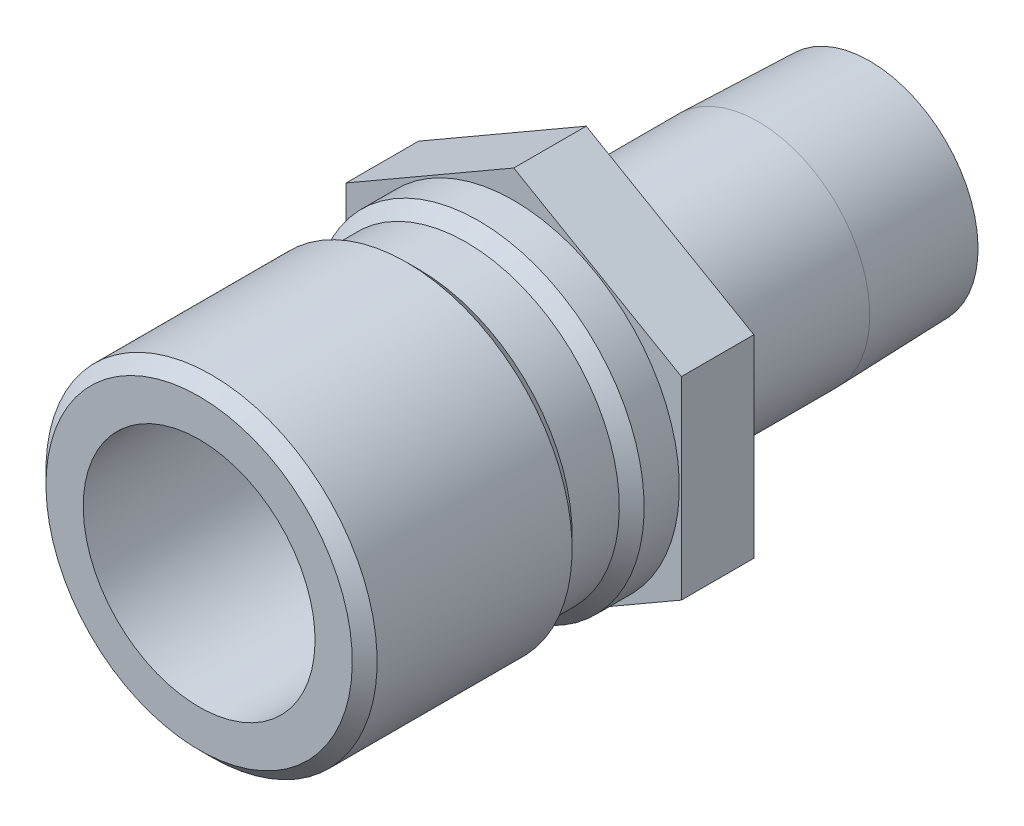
ISO-10303-21;
HEADER;
FILE_DESCRIPTION(('STEP AP214'),'2;1');
FILE_NAME('part.step','',(''),(''),'','','');
FILE_SCHEMA(('AUTOMOTIVE_DESIGN { 1 0 10303 214 1 1 1 1 }'));
ENDSEC;
DATA;
#1=APPLICATION_CONTEXT('core data for automotive mechanical design processes');
#2=APPLICATION_PROTOCOL_DEFINITION('international standard','automotive_design',2000,#1);
#3=PRODUCT_CONTEXT('',#1,'mechanical');
#4=PRODUCT('Part','Part','',(#3));
#5=PRODUCT_RELATED_PRODUCT_CATEGORY('part','',(#4));
#6=PRODUCT_DEFINITION_FORMATION('','',#4);
#7=PRODUCT_DEFINITION_CONTEXT('part definition',#1,'design');
#8=PRODUCT_DEFINITION('design','',#6,#7);
#9=PRODUCT_DEFINITION_SHAPE('','',#8);
#10=(LENGTH_UNIT() NAMED_UNIT(*) SI_UNIT(.MILLI.,.METRE.));
#11=(NAMED_UNIT(*) PLANE_ANGLE_UNIT() SI_UNIT($,.RADIAN.));
#12=(NAMED_UNIT(*) SI_UNIT($,.STERADIAN.) SOLID_ANGLE_UNIT());
#13=UNCERTAINTY_MEASURE_WITH_UNIT(LENGTH_MEASURE(1.E-05),#10,'distance_accuracy_value','');
#14=(GEOMETRIC_REPRESENTATION_CONTEXT(3) GLOBAL_UNCERTAINTY_ASSIGNED_CONTEXT((#13)) GLOBAL_UNIT_ASSIGNED_CONTEXT((#10,
#11,#12)) REPRESENTATION_CONTEXT('',''));
#15=CARTESIAN_POINT('',(0.,0.,0.));
#16=DIRECTION('',(0.,0.,1.));
#17=DIRECTION('',(1.,0.,0.));
#18=AXIS2_PLACEMENT_3D('',#15,#16,#17);
#19=CARTESIAN_POINT('',(0.,0.,0.));
#20=DIRECTION('',(0.,0.,-1.));
#21=DIRECTION('',(0.,1.,0.));
#22=AXIS2_PLACEMENT_3D('',#19,#20,#21);
#23=CYLINDRICAL_SURFACE('',#22,6.85799999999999);
#24=CARTESIAN_POINT('',(0.,0.,-14.986));
#25=DIRECTION('',(0.,0.,-1.));
#26=DIRECTION('',(0.,1.,0.));
#27=AXIS2_PLACEMENT_3D('',#24,#25,#26);
#28=CIRCLE('',#27,6.85799999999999);
#29=CARTESIAN_POINT('',(0.,6.858,-14.986));
#30=VERTEX_POINT('',#29);
#31=EDGE_CURVE('E42',#30,#30,#28,.T.);
#32=ORIENTED_EDGE('',*,*,#31,.F.);
#33=EDGE_LOOP('',(#32));
#34=FACE_BOUND('',#33,.T.);
#35=CARTESIAN_POINT('',(0.,0.,-4.445));
#36=DIRECTION('',(0.,0.,1.));
#37=DIRECTION('',(1.,0.,0.));
#38=AXIS2_PLACEMENT_3D('',#35,#36,#37);
#39=CIRCLE('',#38,6.85799999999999);
#40=CARTESIAN_POINT('',(6.85799999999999,0.,-4.445));
#41=VERTEX_POINT('',#40);
#42=EDGE_CURVE('E138',#41,#41,#39,.F.);
#43=ORIENTED_EDGE('',*,*,#42,.T.);
#44=EDGE_LOOP('',(#43));
#45=FACE_BOUND('',#44,.T.);
#46=ADVANCED_FACE('F33',(#34,#45),#23,.T.);
#47=CARTESIAN_POINT('',(0.,6.6436887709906,-21.844));
#48=DIRECTION('',(0.,0.,-1.));
#49=DIRECTION('',(0.,1.,0.));
#50=AXIS2_PLACEMENT_3D('',#47,#48,#49);
#51=PLANE('',#50);
#52=CARTESIAN_POINT('',(0.,0.,-21.844));
#53=DIRECTION('',(0.,0.,-1.));
#54=DIRECTION('',(0.,1.,0.));
#55=AXIS2_PLACEMENT_3D('',#52,#53,#54);
#56=CIRCLE('',#55,6.6436887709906);
#57=CARTESIAN_POINT('',(0.,6.6436887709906,-21.844));
#58=VERTEX_POINT('',#57);
#59=EDGE_CURVE('E11',#58,#58,#56,.T.);
#60=ORIENTED_EDGE('',*,*,#59,.T.);
#61=EDGE_LOOP('',(#60));
#62=FACE_BOUND('',#61,.T.);
#63=CARTESIAN_POINT('',(0.,0.,-21.844));
#64=DIRECTION('',(0.,0.,-1.));
#65=DIRECTION('',(0.,1.,0.));
#66=AXIS2_PLACEMENT_3D('',#63,#64,#65);
#67=CIRCLE('',#66,4.76249999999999);
#68=CARTESIAN_POINT('',(0.,4.76249999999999,-21.844));
#69=VERTEX_POINT('',#68);
#70=EDGE_CURVE('E146',#69,#69,#67,.T.);
#71=ORIENTED_EDGE('',*,*,#70,.F.);
#72=EDGE_LOOP('',(#71));
#73=FACE_BOUND('',#72,.T.);
#74=ADVANCED_FACE('F35',(#62,#73),#51,.T.);
#75=CARTESIAN_POINT('',(0.,0.,-21.844));
#76=DIRECTION('',(0.,0.,1.));
#77=DIRECTION('',(0.,-1.,0.));
#78=AXIS2_PLACEMENT_3D('',#75,#76,#77);
#79=CONICAL_SURFACE('',#78,6.6436887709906,0.0312396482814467);
#80=ORIENTED_EDGE('',*,*,#31,.T.);
#81=EDGE_LOOP('',(#80));
#82=FACE_BOUND('',#81,.T.);
#83=ORIENTED_EDGE('',*,*,#59,.F.);
#84=EDGE_LOOP('',(#83));
#85=FACE_BOUND('',#84,.T.);
#86=ADVANCED_FACE('F181',(#82,#85),#79,.T.);
#87=CARTESIAN_POINT('',(0.,0.,0.));
#88=DIRECTION('',(0.,0.,-1.));
#89=DIRECTION('',(0.,1.,0.));
#90=AXIS2_PLACEMENT_3D('',#87,#88,#89);
#91=CYLINDRICAL_SURFACE('',#90,10.16);
#92=CARTESIAN_POINT('',(0.,0.,2.159));
#93=DIRECTION('',(0.,0.,-1.));
#94=DIRECTION('',(0.,1.,0.));
#95=AXIS2_PLACEMENT_3D('',#92,#93,#94);
#96=CIRCLE('',#95,10.16);
#97=CARTESIAN_POINT('',(0.,10.16,2.159));
#98=VERTEX_POINT('',#97);
#99=EDGE_CURVE('E173',#98,#98,#96,.T.);
#100=ORIENTED_EDGE('',*,*,#99,.T.);
#101=EDGE_LOOP('',(#100));
#102=FACE_BOUND('',#101,.T.);
#103=CARTESIAN_POINT('',(0.,0.,0.));
#104=DIRECTION('',(0.,0.,-1.));
#105=DIRECTION('',(0.,1.,0.));
#106=AXIS2_PLACEMENT_3D('',#103,#104,#105);
#107=CIRCLE('',#106,10.16);
#108=CARTESIAN_POINT('',(0.,10.16,0.));
#109=VERTEX_POINT('',#108);
#110=EDGE_CURVE('E176',#109,#109,#107,.T.);
#111=ORIENTED_EDGE('',*,*,#110,.F.);
#112=EDGE_LOOP('',(#111));
#113=FACE_BOUND('',#112,.T.);
#114=ADVANCED_FACE('F250',(#102,#113),#91,.T.);
#115=CARTESIAN_POINT('',(0.,0.,2.159));
#116=DIRECTION('',(0.,0.,-1.));
#117=DIRECTION('',(0.,1.,0.));
#118=AXIS2_PLACEMENT_3D('',#115,#116,#117);
#119=CONICAL_SURFACE('',#118,10.16,0.785398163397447);
#120=CARTESIAN_POINT('',(0.,0.,2.921));
#121=DIRECTION('',(0.,0.,-1.));
#122=DIRECTION('',(0.,1.,0.));
#123=AXIS2_PLACEMENT_3D('',#120,#121,#122);
#124=CIRCLE('',#123,9.398);
#125=CARTESIAN_POINT('',(0.,9.398,2.921));
#126=VERTEX_POINT('',#125);
#127=EDGE_CURVE('E170',#126,#126,#124,.T.);
#128=ORIENTED_EDGE('',*,*,#127,.T.);
#129=EDGE_LOOP('',(#128));
#130=FACE_BOUND('',#129,.T.);
#131=ORIENTED_EDGE('',*,*,#99,.F.);
#132=EDGE_LOOP('',(#131));
#133=FACE_BOUND('',#132,.T.);
#134=ADVANCED_FACE('F246',(#130,#133),#119,.T.);
#135=CARTESIAN_POINT('',(0.,0.,0.));
#136=DIRECTION('',(0.,0.,-1.));
#137=DIRECTION('',(0.,1.,0.));
#138=AXIS2_PLACEMENT_3D('',#135,#136,#137);
#139=CYLINDRICAL_SURFACE('',#138,9.398);
#140=CARTESIAN_POINT('',(0.,0.,5.8166));
#141=DIRECTION('',(0.,0.,-1.));
#142=DIRECTION('',(0.,1.,0.));
#143=AXIS2_PLACEMENT_3D('',#140,#141,#142);
#144=CIRCLE('',#143,9.398);
#145=CARTESIAN_POINT('',(0.,9.398,5.8166));
#146=VERTEX_POINT('',#145);
#147=EDGE_CURVE('E167',#146,#146,#144,.T.);
#148=ORIENTED_EDGE('',*,*,#147,.T.);
#149=EDGE_LOOP('',(#148));
#150=FACE_BOUND('',#149,.T.);
#151=ORIENTED_EDGE('',*,*,#127,.F.);
#152=EDGE_LOOP('',(#151));
#153=FACE_BOUND('',#152,.T.);
#154=ADVANCED_FACE('F242',(#150,#153),#139,.T.);
#155=CARTESIAN_POINT('',(0.,0.,5.8166));
#156=DIRECTION('',(0.,0.,1.));
#157=DIRECTION('',(0.,-1.,0.));
#158=AXIS2_PLACEMENT_3D('',#155,#156,#157);
#159=CONICAL_SURFACE('',#158,9.398,0.785398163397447);
#160=CARTESIAN_POINT('',(0.,0.,6.5786));
#161=DIRECTION('',(0.,0.,-1.));
#162=DIRECTION('',(0.,1.,0.));
#163=AXIS2_PLACEMENT_3D('',#160,#161,#162);
#164=CIRCLE('',#163,10.16);
#165=CARTESIAN_POINT('',(0.,10.16,6.5786));
#166=VERTEX_POINT('',#165);
#167=EDGE_CURVE('E164',#166,#166,#164,.T.);
#168=ORIENTED_EDGE('',*,*,#167,.T.);
#169=EDGE_LOOP('',(#168));
#170=FACE_BOUND('',#169,.T.);
#171=ORIENTED_EDGE('',*,*,#147,.F.);
#172=EDGE_LOOP('',(#171));
#173=FACE_BOUND('',#172,.T.);
#174=ADVANCED_FACE('F238',(#170,#173),#159,.T.);
#175=CARTESIAN_POINT('',(0.,0.,0.));
#176=DIRECTION('',(0.,0.,-1.));
#177=DIRECTION('',(0.,1.,0.));
#178=AXIS2_PLACEMENT_3D('',#175,#176,#177);
#179=CYLINDRICAL_SURFACE('',#178,10.16);
#180=CARTESIAN_POINT('',(0.,0.,18.542));
#181=DIRECTION('',(0.,0.,-1.));
#182=DIRECTION('',(0.,1.,0.));
#183=AXIS2_PLACEMENT_3D('',#180,#181,#182);
#184=CIRCLE('',#183,10.16);
#185=CARTESIAN_POINT('',(0.,10.16,18.542));
#186=VERTEX_POINT('',#185);
#187=EDGE_CURVE('E161',#186,#186,#184,.T.);
#188=ORIENTED_EDGE('',*,*,#187,.T.);
#189=EDGE_LOOP('',(#188));
#190=FACE_BOUND('',#189,.T.);
#191=ORIENTED_EDGE('',*,*,#167,.F.);
#192=EDGE_LOOP('',(#191));
#193=FACE_BOUND('',#192,.T.);
#194=ADVANCED_FACE('F234',(#190,#193),#179,.T.);
#195=CARTESIAN_POINT('',(0.,0.,18.542));
#196=DIRECTION('',(0.,0.,-1.));
#197=DIRECTION('',(0.,1.,0.));
#198=AXIS2_PLACEMENT_3D('',#195,#196,#197);
#199=CONICAL_SURFACE('',#198,10.16,0.785398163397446);
#200=CARTESIAN_POINT('',(0.,0.,19.304));
#201=DIRECTION('',(0.,0.,-1.));
#202=DIRECTION('',(0.,1.,0.));
#203=AXIS2_PLACEMENT_3D('',#200,#201,#202);
#204=CIRCLE('',#203,9.398);
#205=CARTESIAN_POINT('',(0.,9.398,19.304));
#206=VERTEX_POINT('',#205);
#207=EDGE_CURVE('E158',#206,#206,#204,.T.);
#208=ORIENTED_EDGE('',*,*,#207,.T.);
#209=EDGE_LOOP('',(#208));
#210=FACE_BOUND('',#209,.T.);
#211=ORIENTED_EDGE('',*,*,#187,.F.);
#212=EDGE_LOOP('',(#211));
#213=FACE_BOUND('',#212,.T.);
#214=ADVANCED_FACE('F230',(#210,#213),#199,.T.);
#215=CARTESIAN_POINT('',(0.,7.112,19.304));
#216=DIRECTION('',(0.,0.,1.));
#217=DIRECTION('',(0.,-1.,0.));
#218=AXIS2_PLACEMENT_3D('',#215,#216,#217);
#219=PLANE('',#218);
#220=CARTESIAN_POINT('',(0.,0.,19.304));
#221=DIRECTION('',(0.,0.,-1.));
#222=DIRECTION('',(0.,1.,0.));
#223=AXIS2_PLACEMENT_3D('',#220,#221,#222);
#224=CIRCLE('',#223,7.112);
#225=CARTESIAN_POINT('',(0.,7.112,19.304));
#226=VERTEX_POINT('',#225);
#227=EDGE_CURVE('E155',#226,#226,#224,.T.);
#228=ORIENTED_EDGE('',*,*,#227,.T.);
#229=EDGE_LOOP('',(#228));
#230=FACE_BOUND('',#229,.T.);
#231=ORIENTED_EDGE('',*,*,#207,.F.);
#232=EDGE_LOOP('',(#231));
#233=FACE_BOUND('',#232,.T.);
#234=ADVANCED_FACE('F226',(#230,#233),#219,.T.);
#235=CARTESIAN_POINT('',(0.,0.,0.));
#236=DIRECTION('',(0.,0.,-1.));
#237=DIRECTION('',(0.,1.,0.));
#238=AXIS2_PLACEMENT_3D('',#235,#236,#237);
#239=CYLINDRICAL_SURFACE('',#238,7.112);
#240=CARTESIAN_POINT('',(0.,0.,1.524));
#241=DIRECTION('',(0.,0.,-1.));
#242=DIRECTION('',(0.,1.,0.));
#243=AXIS2_PLACEMENT_3D('',#240,#241,#242);
#244=CIRCLE('',#243,7.112);
#245=CARTESIAN_POINT('',(0.,7.112,1.524));
#246=VERTEX_POINT('',#245);
#247=EDGE_CURVE('E152',#246,#246,#244,.T.);
#248=ORIENTED_EDGE('',*,*,#247,.T.);
#249=EDGE_LOOP('',(#248));
#250=FACE_BOUND('',#249,.T.);
#251=ORIENTED_EDGE('',*,*,#227,.F.);
#252=EDGE_LOOP('',(#251));
#253=FACE_BOUND('',#252,.T.);
#254=ADVANCED_FACE('F222',(#250,#253),#239,.F.);
#255=CARTESIAN_POINT('',(0.,0.,1.524));
#256=DIRECTION('',(0.,0.,1.));
#257=DIRECTION('',(0.,-1.,0.));
#258=AXIS2_PLACEMENT_3D('',#255,#256,#257);
#259=CONICAL_SURFACE('',#258,7.112,1.08210413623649);
#260=CARTESIAN_POINT('',(0.,0.,0.274748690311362));
#261=DIRECTION('',(0.,0.,-1.));
#262=DIRECTION('',(0.,1.,0.));
#263=AXIS2_PLACEMENT_3D('',#260,#261,#262);
#264=CIRCLE('',#263,4.7625);
#265=CARTESIAN_POINT('',(0.,4.7625,0.274748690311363));
#266=VERTEX_POINT('',#265);
#267=EDGE_CURVE('E149',#266,#266,#264,.T.);
#268=ORIENTED_EDGE('',*,*,#267,.T.);
#269=EDGE_LOOP('',(#268));
#270=FACE_BOUND('',#269,.T.);
#271=ORIENTED_EDGE('',*,*,#247,.F.);
#272=EDGE_LOOP('',(#271));
#273=FACE_BOUND('',#272,.T.);
#274=ADVANCED_FACE('F218',(#270,#273),#259,.F.);
#275=CARTESIAN_POINT('',(0.,0.,0.));
#276=DIRECTION('',(0.,0.,-1.));
#277=DIRECTION('',(0.,1.,0.));
#278=AXIS2_PLACEMENT_3D('',#275,#276,#277);
#279=CYLINDRICAL_SURFACE('',#278,4.76249999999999);
#280=ORIENTED_EDGE('',*,*,#267,.F.);
#281=EDGE_LOOP('',(#280));
#282=FACE_BOUND('',#281,.T.);
#283=ORIENTED_EDGE('',*,*,#70,.T.);
#284=EDGE_LOOP('',(#283));
#285=FACE_BOUND('',#284,.T.);
#286=ADVANCED_FACE('F215',(#282,#285),#279,.F.);
#287=CARTESIAN_POINT('',(0.,11.8784044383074,-4.445));
#288=DIRECTION('',(-0.5,0.866025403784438,0.));
#289=DIRECTION('',(-0.866025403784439,-0.5,0.));
#290=AXIS2_PLACEMENT_3D('',#287,#288,#289);
#291=PLANE('',#290);
#292=DIRECTION('',(-0.866025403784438,-0.5,0.));
#293=VECTOR('',#292,1.);
#294=CARTESIAN_POINT('',(0.,11.8784044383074,0.));
#295=LINE('',#294,#293);
#296=CARTESIAN_POINT('',(0.,11.8784044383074,0.));
#297=VERTEX_POINT('',#296);
#298=CARTESIAN_POINT('',(-10.287,5.93920221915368,0.));
#299=VERTEX_POINT('',#298);
#300=EDGE_CURVE('E121',#297,#299,#295,.T.);
#301=ORIENTED_EDGE('',*,*,#300,.F.);
#302=DIRECTION('',(0.,0.,1.));
#303=VECTOR('',#302,1.);
#304=CARTESIAN_POINT('',(0.,11.8784044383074,-4.445));
#305=LINE('',#304,#303);
#306=CARTESIAN_POINT('',(0.,11.8784044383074,-4.445));
#307=VERTEX_POINT('',#306);
#308=EDGE_CURVE('E50',#307,#297,#305,.T.);
#309=ORIENTED_EDGE('',*,*,#308,.F.);
#310=DIRECTION('',(-0.866025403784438,-0.5,0.));
#311=VECTOR('',#310,1.);
#312=CARTESIAN_POINT('',(0.,11.8784044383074,-4.445));
#313=LINE('',#312,#311);
#314=CARTESIAN_POINT('',(-10.287,5.93920221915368,-4.445));
#315=VERTEX_POINT('',#314);
#316=EDGE_CURVE('E136',#307,#315,#313,.T.);
#317=ORIENTED_EDGE('',*,*,#316,.T.);
#318=DIRECTION('',(0.,0.,1.));
#319=VECTOR('',#318,1.);
#320=CARTESIAN_POINT('',(-10.287,5.93920221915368,-4.445));
#321=LINE('',#320,#319);
#322=EDGE_CURVE('E85',#315,#299,#321,.T.);
#323=ORIENTED_EDGE('',*,*,#322,.T.);
#324=EDGE_LOOP('',(#301,#309,#317,#323));
#325=FACE_BOUND('',#324,.T.);
#326=ADVANCED_FACE('F205',(#325),#291,.T.);
#327=CARTESIAN_POINT('',(10.287,5.93920221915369,-4.445));
#328=DIRECTION('',(0.5,0.866025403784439,0.));
#329=DIRECTION('',(-0.866025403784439,0.5,0.));
#330=AXIS2_PLACEMENT_3D('',#327,#328,#329);
#331=PLANE('',#330);
#332=DIRECTION('',(-0.866025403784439,0.5,0.));
#333=VECTOR('',#332,1.);
#334=CARTESIAN_POINT('',(10.287,5.93920221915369,0.));
#335=LINE('',#334,#333);
#336=CARTESIAN_POINT('',(10.287,5.93920221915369,0.));
#337=VERTEX_POINT('',#336);
#338=EDGE_CURVE('E133',#337,#297,#335,.T.);
#339=ORIENTED_EDGE('',*,*,#338,.F.);
#340=DIRECTION('',(0.,0.,1.));
#341=VECTOR('',#340,1.);
#342=CARTESIAN_POINT('',(10.287,5.93920221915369,-4.445));
#343=LINE('',#342,#341);
#344=CARTESIAN_POINT('',(10.287,5.93920221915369,-4.445));
#345=VERTEX_POINT('',#344);
#346=EDGE_CURVE('E73',#345,#337,#343,.T.);
#347=ORIENTED_EDGE('',*,*,#346,.F.);
#348=DIRECTION('',(-0.866025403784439,0.5,0.));
#349=VECTOR('',#348,1.);
#350=CARTESIAN_POINT('',(10.287,5.93920221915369,-4.445));
#351=LINE('',#350,#349);
#352=EDGE_CURVE('E111',#345,#307,#351,.T.);
#353=ORIENTED_EDGE('',*,*,#352,.T.);
#354=ORIENTED_EDGE('',*,*,#308,.T.);
#355=EDGE_LOOP('',(#339,#347,#353,#354));
#356=FACE_BOUND('',#355,.T.);
#357=ADVANCED_FACE('F202',(#356),#331,.T.);
#358=CARTESIAN_POINT('',(10.287,-5.93920221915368,-4.445));
#359=DIRECTION('',(1.,0.,0.));
#360=DIRECTION('',(0.,0.,-1.));
#361=AXIS2_PLACEMENT_3D('',#358,#359,#360);
#362=PLANE('',#361);
#363=DIRECTION('',(0.,1.,0.));
#364=VECTOR('',#363,1.);
#365=CARTESIAN_POINT('',(10.287,-5.93920221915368,0.));
#366=LINE('',#365,#364);
#367=CARTESIAN_POINT('',(10.287,-5.93920221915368,0.));
#368=VERTEX_POINT('',#367);
#369=EDGE_CURVE('E98',#368,#337,#366,.T.);
#370=ORIENTED_EDGE('',*,*,#369,.F.);
#371=DIRECTION('',(0.,0.,1.));
#372=VECTOR('',#371,1.);
#373=CARTESIAN_POINT('',(10.287,-5.93920221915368,-4.445));
#374=LINE('',#373,#372);
#375=CARTESIAN_POINT('',(10.287,-5.93920221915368,-4.445));
#376=VERTEX_POINT('',#375);
#377=EDGE_CURVE('E93',#376,#368,#374,.T.);
#378=ORIENTED_EDGE('',*,*,#377,.F.);
#379=DIRECTION('',(0.,1.,0.));
#380=VECTOR('',#379,1.);
#381=CARTESIAN_POINT('',(10.287,-5.93920221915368,-4.445));
#382=LINE('',#381,#380);
#383=EDGE_CURVE('E96',#376,#345,#382,.T.);
#384=ORIENTED_EDGE('',*,*,#383,.T.);
#385=ORIENTED_EDGE('',*,*,#346,.T.);
#386=EDGE_LOOP('',(#370,#378,#384,#385));
#387=FACE_BOUND('',#386,.T.);
#388=ADVANCED_FACE('F95',(#387),#362,.T.);
#389=CARTESIAN_POINT('',(0.,-11.8784044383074,-4.445));
#390=DIRECTION('',(0.5,-0.866025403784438,0.));
#391=DIRECTION('',(0.866025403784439,0.5,0.));
#392=AXIS2_PLACEMENT_3D('',#389,#390,#391);
#393=PLANE('',#392);
#394=DIRECTION('',(0.866025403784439,0.5,0.));
#395=VECTOR('',#394,1.);
#396=CARTESIAN_POINT('',(0.,-11.8784044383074,0.));
#397=LINE('',#396,#395);
#398=CARTESIAN_POINT('',(0.,-11.8784044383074,0.));
#399=VERTEX_POINT('',#398);
#400=EDGE_CURVE('E130',#399,#368,#397,.T.);
#401=ORIENTED_EDGE('',*,*,#400,.F.);
#402=DIRECTION('',(0.,0.,1.));
#403=VECTOR('',#402,1.);
#404=CARTESIAN_POINT('',(0.,-11.8784044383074,-4.445));
#405=LINE('',#404,#403);
#406=CARTESIAN_POINT('',(0.,-11.8784044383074,-4.445));
#407=VERTEX_POINT('',#406);
#408=EDGE_CURVE('E103',#407,#399,#405,.T.);
#409=ORIENTED_EDGE('',*,*,#408,.F.);
#410=DIRECTION('',(0.866025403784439,0.5,0.));
#411=VECTOR('',#410,1.);
#412=CARTESIAN_POINT('',(0.,-11.8784044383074,-4.445));
#413=LINE('',#412,#411);
#414=EDGE_CURVE('E109',#407,#376,#413,.T.);
#415=ORIENTED_EDGE('',*,*,#414,.T.);
#416=ORIENTED_EDGE('',*,*,#377,.T.);
#417=EDGE_LOOP('',(#401,#409,#415,#416));
#418=FACE_BOUND('',#417,.T.);
#419=ADVANCED_FACE('F113',(#418),#393,.T.);
#420=CARTESIAN_POINT('',(-10.287,-5.93920221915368,-4.445));
#421=DIRECTION('',(-0.5,-0.866025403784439,0.));
#422=DIRECTION('',(0.866025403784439,-0.5,0.));
#423=AXIS2_PLACEMENT_3D('',#420,#421,#422);
#424=PLANE('',#423);
#425=DIRECTION('',(0.866025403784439,-0.5,0.));
#426=VECTOR('',#425,1.);
#427=CARTESIAN_POINT('',(-10.287,-5.93920221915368,0.));
#428=LINE('',#427,#426);
#429=CARTESIAN_POINT('',(-10.287,-5.93920221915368,0.));
#430=VERTEX_POINT('',#429);
#431=EDGE_CURVE('E127',#430,#399,#428,.T.);
#432=ORIENTED_EDGE('',*,*,#431,.F.);
#433=DIRECTION('',(0.,0.,1.));
#434=VECTOR('',#433,1.);
#435=CARTESIAN_POINT('',(-10.287,-5.93920221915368,-4.445));
#436=LINE('',#435,#434);
#437=CARTESIAN_POINT('',(-10.287,-5.93920221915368,-4.445));
#438=VERTEX_POINT('',#437);
#439=EDGE_CURVE('E141',#438,#430,#436,.T.);
#440=ORIENTED_EDGE('',*,*,#439,.F.);
#441=DIRECTION('',(0.866025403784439,-0.5,0.));
#442=VECTOR('',#441,1.);
#443=CARTESIAN_POINT('',(-10.287,-5.93920221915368,-4.445));
#444=LINE('',#443,#442);
#445=EDGE_CURVE('E114',#438,#407,#444,.T.);
#446=ORIENTED_EDGE('',*,*,#445,.T.);
#447=ORIENTED_EDGE('',*,*,#408,.T.);
#448=EDGE_LOOP('',(#432,#440,#446,#447));
#449=FACE_BOUND('',#448,.T.);
#450=ADVANCED_FACE('F199',(#449),#424,.T.);
#451=CARTESIAN_POINT('',(-10.287,5.93920221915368,-4.445));
#452=DIRECTION('',(-1.,0.,0.));
#453=DIRECTION('',(0.,0.,1.));
#454=AXIS2_PLACEMENT_3D('',#451,#452,#453);
#455=PLANE('',#454);
#456=DIRECTION('',(0.,-1.,0.));
#457=VECTOR('',#456,1.);
#458=CARTESIAN_POINT('',(-10.287,5.93920221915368,0.));
#459=LINE('',#458,#457);
#460=EDGE_CURVE('E124',#299,#430,#459,.T.);
#461=ORIENTED_EDGE('',*,*,#460,.F.);
#462=ORIENTED_EDGE('',*,*,#322,.F.);
#463=DIRECTION('',(0.,-1.,0.));
#464=VECTOR('',#463,1.);
#465=CARTESIAN_POINT('',(-10.287,5.93920221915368,-4.445));
#466=LINE('',#465,#464);
#467=EDGE_CURVE('E116',#315,#438,#466,.T.);
#468=ORIENTED_EDGE('',*,*,#467,.T.);
#469=ORIENTED_EDGE('',*,*,#439,.T.);
#470=EDGE_LOOP('',(#461,#462,#468,#469));
#471=FACE_BOUND('',#470,.T.);
#472=ADVANCED_FACE('F191',(#471),#455,.T.);
#473=CARTESIAN_POINT('',(-10.287,5.93920221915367,-4.445));
#474=DIRECTION('',(0.,0.,1.));
#475=DIRECTION('',(1.,0.,0.));
#476=AXIS2_PLACEMENT_3D('',#473,#474,#475);
#477=PLANE('',#476);
#478=ORIENTED_EDGE('',*,*,#42,.F.);
#479=EDGE_LOOP('',(#478));
#480=FACE_BOUND('',#479,.T.);
#481=ORIENTED_EDGE('',*,*,#316,.F.);
#482=ORIENTED_EDGE('',*,*,#352,.F.);
#483=ORIENTED_EDGE('',*,*,#383,.F.);
#484=ORIENTED_EDGE('',*,*,#414,.F.);
#485=ORIENTED_EDGE('',*,*,#445,.F.);
#486=ORIENTED_EDGE('',*,*,#467,.F.);
#487=EDGE_LOOP('',(#481,#482,#483,#484,#485,#486));
#488=FACE_BOUND('',#487,.T.);
#489=ADVANCED_FACE('F107',(#480,#488),#477,.F.);
#490=CARTESIAN_POINT('',(-10.287,5.93920221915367,0.));
#491=DIRECTION('',(0.,0.,1.));
#492=DIRECTION('',(1.,0.,0.));
#493=AXIS2_PLACEMENT_3D('',#490,#491,#492);
#494=PLANE('',#493);
#495=ORIENTED_EDGE('',*,*,#110,.T.);
#496=EDGE_LOOP('',(#495));
#497=FACE_BOUND('',#496,.T.);
#498=ORIENTED_EDGE('',*,*,#300,.T.);
#499=ORIENTED_EDGE('',*,*,#460,.T.);
#500=ORIENTED_EDGE('',*,*,#431,.T.);
#501=ORIENTED_EDGE('',*,*,#400,.T.);
#502=ORIENTED_EDGE('',*,*,#369,.T.);
#503=ORIENTED_EDGE('',*,*,#338,.T.);
#504=EDGE_LOOP('',(#498,#499,#500,#501,#502,#503));
#505=FACE_BOUND('',#504,.T.);
#506=ADVANCED_FACE('F190',(#497,#505),#494,.T.);
#507=CLOSED_SHELL('',(#46,#74,#86,#114,#134,#154,#174,#194,#214,#234,#254,#274,#286,#326,#357,
#388,#419,#450,#472,#489,#506));
#508=MANIFOLD_SOLID_BREP('B2',#507);
#509=ADVANCED_BREP_SHAPE_REPRESENTATION('',(#18,#508),#14);
#510=SHAPE_DEFINITION_REPRESENTATION(#9,#509);
ENDSEC;
END-ISO-10303-21;
